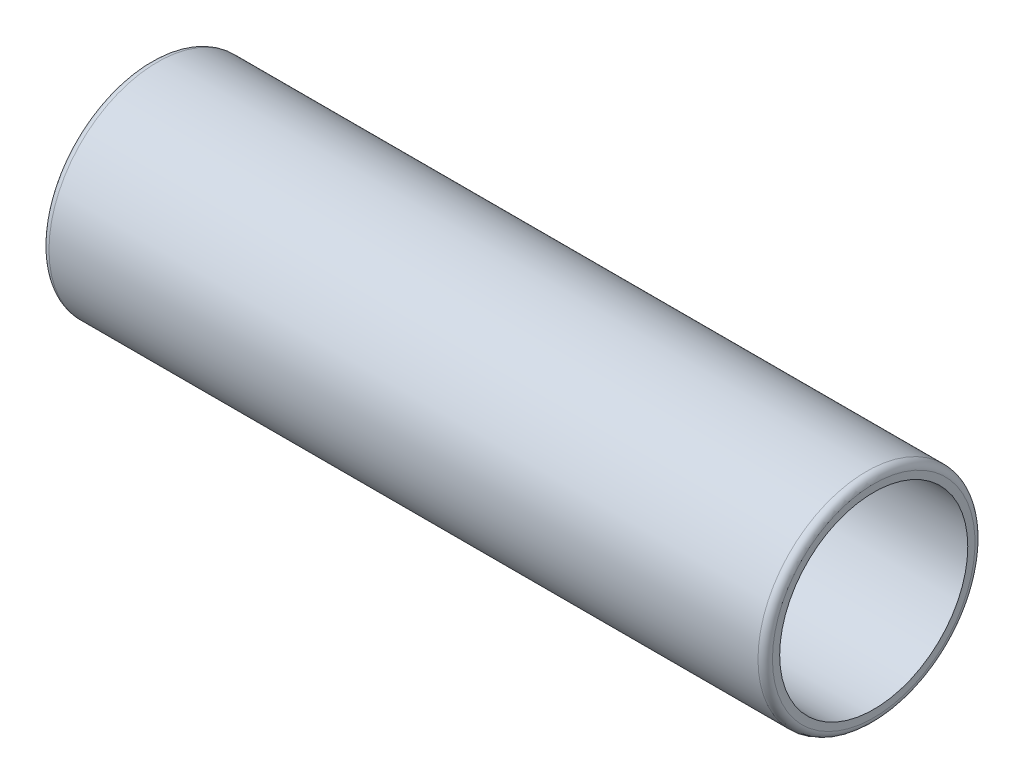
ISO-10303-21;
HEADER;
FILE_DESCRIPTION(('STEP AP214'),'2;1');
FILE_NAME('part.step','',(''),(''),'','','');
FILE_SCHEMA(('AUTOMOTIVE_DESIGN { 1 0 10303 214 1 1 1 1 }'));
ENDSEC;
DATA;
#1=APPLICATION_CONTEXT('core data for automotive mechanical design processes');
#2=APPLICATION_PROTOCOL_DEFINITION('international standard','automotive_design',2000,#1);
#3=PRODUCT_CONTEXT('',#1,'mechanical');
#4=PRODUCT('Part','Part','',(#3));
#5=PRODUCT_RELATED_PRODUCT_CATEGORY('part','',(#4));
#6=PRODUCT_DEFINITION_FORMATION('','',#4);
#7=PRODUCT_DEFINITION_CONTEXT('part definition',#1,'design');
#8=PRODUCT_DEFINITION('design','',#6,#7);
#9=PRODUCT_DEFINITION_SHAPE('','',#8);
#10=(LENGTH_UNIT() NAMED_UNIT(*) SI_UNIT(.MILLI.,.METRE.));
#11=(NAMED_UNIT(*) PLANE_ANGLE_UNIT() SI_UNIT($,.RADIAN.));
#12=(NAMED_UNIT(*) SI_UNIT($,.STERADIAN.) SOLID_ANGLE_UNIT());
#13=UNCERTAINTY_MEASURE_WITH_UNIT(LENGTH_MEASURE(1.E-05),#10,'distance_accuracy_value','');
#14=(GEOMETRIC_REPRESENTATION_CONTEXT(3) GLOBAL_UNCERTAINTY_ASSIGNED_CONTEXT((#13)) GLOBAL_UNIT_ASSIGNED_CONTEXT((#10,
#11,#12)) REPRESENTATION_CONTEXT('',''));
#15=CARTESIAN_POINT('',(0.,0.,0.));
#16=DIRECTION('',(0.,0.,1.));
#17=DIRECTION('',(1.,0.,0.));
#18=AXIS2_PLACEMENT_3D('',#15,#16,#17);
#19=CARTESIAN_POINT('',(0.,0.,0.));
#20=DIRECTION('',(-1.,0.,0.));
#21=DIRECTION('',(0.,0.,1.));
#22=AXIS2_PLACEMENT_3D('',#19,#20,#21);
#23=CYLINDRICAL_SURFACE('',#22,6.);
#24=CARTESIAN_POINT('',(6.,0.,0.));
#25=DIRECTION('',(-1.,0.,0.));
#26=DIRECTION('',(0.,0.,1.));
#27=AXIS2_PLACEMENT_3D('',#24,#25,#26);
#28=CIRCLE('',#27,6.);
#29=CARTESIAN_POINT('',(6.,0.,6.));
#30=VERTEX_POINT('',#29);
#31=EDGE_CURVE('E43',#30,#30,#28,.T.);
#32=ORIENTED_EDGE('',*,*,#31,.F.);
#33=EDGE_LOOP('',(#32));
#34=FACE_BOUND('',#33,.T.);
#35=CARTESIAN_POINT('',(0.,0.,0.));
#36=DIRECTION('',(-1.,0.,0.));
#37=DIRECTION('',(0.,0.,1.));
#38=AXIS2_PLACEMENT_3D('',#35,#36,#37);
#39=CIRCLE('',#38,6.);
#40=CARTESIAN_POINT('',(0.,0.,6.));
#41=VERTEX_POINT('',#40);
#42=EDGE_CURVE('E34',#41,#41,#39,.T.);
#43=ORIENTED_EDGE('',*,*,#42,.T.);
#44=EDGE_LOOP('',(#43));
#45=FACE_BOUND('',#44,.T.);
#46=ADVANCED_FACE('F14',(#34,#45),#23,.F.);
#47=CARTESIAN_POINT('',(0.,6.,0.));
#48=DIRECTION('',(1.,0.,0.));
#49=DIRECTION('',(0.,0.,-1.));
#50=AXIS2_PLACEMENT_3D('',#47,#48,#49);
#51=PLANE('',#50);
#52=CARTESIAN_POINT('',(0.,0.,0.));
#53=DIRECTION('',(1.,0.,0.));
#54=DIRECTION('',(0.,0.,-1.));
#55=AXIS2_PLACEMENT_3D('',#52,#53,#54);
#56=CIRCLE('',#55,14.);
#57=CARTESIAN_POINT('',(0.,0.,-14.));
#58=VERTEX_POINT('',#57);
#59=EDGE_CURVE('E21',#58,#58,#56,.F.);
#60=ORIENTED_EDGE('',*,*,#59,.T.);
#61=EDGE_LOOP('',(#60));
#62=FACE_BOUND('',#61,.T.);
#63=ORIENTED_EDGE('',*,*,#42,.F.);
#64=EDGE_LOOP('',(#63));
#65=FACE_BOUND('',#64,.T.);
#66=ADVANCED_FACE('F51',(#62,#65),#51,.F.);
#67=CARTESIAN_POINT('',(0.,0.,0.));
#68=DIRECTION('',(-1.,0.,0.));
#69=DIRECTION('',(0.,0.,1.));
#70=AXIS2_PLACEMENT_3D('',#67,#68,#69);
#71=CYLINDRICAL_SURFACE('',#70,15.);
#72=CARTESIAN_POINT('',(1.,0.,0.));
#73=DIRECTION('',(1.,0.,0.));
#74=DIRECTION('',(0.,0.,-1.));
#75=AXIS2_PLACEMENT_3D('',#72,#73,#74);
#76=CIRCLE('',#75,15.);
#77=CARTESIAN_POINT('',(1.,0.,-15.));
#78=VERTEX_POINT('',#77);
#79=EDGE_CURVE('E9',#78,#78,#76,.T.);
#80=ORIENTED_EDGE('',*,*,#79,.T.);
#81=EDGE_LOOP('',(#80));
#82=FACE_BOUND('',#81,.T.);
#83=CARTESIAN_POINT('',(99.,0.,0.));
#84=DIRECTION('',(-1.,0.,0.));
#85=DIRECTION('',(0.,0.,1.));
#86=AXIS2_PLACEMENT_3D('',#83,#84,#85);
#87=CIRCLE('',#86,15.);
#88=CARTESIAN_POINT('',(99.,0.,15.));
#89=VERTEX_POINT('',#88);
#90=EDGE_CURVE('E29',#89,#89,#87,.T.);
#91=ORIENTED_EDGE('',*,*,#90,.T.);
#92=EDGE_LOOP('',(#91));
#93=FACE_BOUND('',#92,.T.);
#94=ADVANCED_FACE('F56',(#82,#93),#71,.T.);
#95=CARTESIAN_POINT('',(100.,15.,0.));
#96=DIRECTION('',(-1.,0.,0.));
#97=DIRECTION('',(0.,0.,1.));
#98=AXIS2_PLACEMENT_3D('',#95,#96,#97);
#99=PLANE('',#98);
#100=CARTESIAN_POINT('',(100.,0.,0.));
#101=DIRECTION('',(-1.,0.,0.));
#102=DIRECTION('',(0.,0.,1.));
#103=AXIS2_PLACEMENT_3D('',#100,#101,#102);
#104=CIRCLE('',#103,14.);
#105=CARTESIAN_POINT('',(100.,0.,14.));
#106=VERTEX_POINT('',#105);
#107=EDGE_CURVE('E25',#106,#106,#104,.F.);
#108=ORIENTED_EDGE('',*,*,#107,.T.);
#109=EDGE_LOOP('',(#108));
#110=FACE_BOUND('',#109,.T.);
#111=CARTESIAN_POINT('',(100.,0.,0.));
#112=DIRECTION('',(-1.,0.,0.));
#113=DIRECTION('',(0.,0.,1.));
#114=AXIS2_PLACEMENT_3D('',#111,#112,#113);
#115=CIRCLE('',#114,13.);
#116=CARTESIAN_POINT('',(100.,0.,13.));
#117=VERTEX_POINT('',#116);
#118=EDGE_CURVE('E37',#117,#117,#115,.T.);
#119=ORIENTED_EDGE('',*,*,#118,.T.);
#120=EDGE_LOOP('',(#119));
#121=FACE_BOUND('',#120,.T.);
#122=ADVANCED_FACE('F63',(#110,#121),#99,.F.);
#123=CARTESIAN_POINT('',(0.,0.,0.));
#124=DIRECTION('',(-1.,0.,0.));
#125=DIRECTION('',(0.,0.,1.));
#126=AXIS2_PLACEMENT_3D('',#123,#124,#125);
#127=CYLINDRICAL_SURFACE('',#126,13.);
#128=ORIENTED_EDGE('',*,*,#118,.F.);
#129=EDGE_LOOP('',(#128));
#130=FACE_BOUND('',#129,.T.);
#131=CARTESIAN_POINT('',(13.,0.,0.));
#132=DIRECTION('',(-1.,0.,0.));
#133=DIRECTION('',(0.,0.,1.));
#134=AXIS2_PLACEMENT_3D('',#131,#132,#133);
#135=CIRCLE('',#134,13.);
#136=CARTESIAN_POINT('',(13.,0.,13.));
#137=VERTEX_POINT('',#136);
#138=EDGE_CURVE('E40',#137,#137,#135,.T.);
#139=ORIENTED_EDGE('',*,*,#138,.T.);
#140=EDGE_LOOP('',(#139));
#141=FACE_BOUND('',#140,.T.);
#142=ADVANCED_FACE('F75',(#130,#141),#127,.F.);
#143=CARTESIAN_POINT('',(6.,0.,0.));
#144=DIRECTION('',(1.,0.,0.));
#145=DIRECTION('',(0.,0.,-1.));
#146=AXIS2_PLACEMENT_3D('',#143,#144,#145);
#147=CONICAL_SURFACE('',#146,6.,0.785398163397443);
#148=ORIENTED_EDGE('',*,*,#138,.F.);
#149=EDGE_LOOP('',(#148));
#150=FACE_BOUND('',#149,.T.);
#151=ORIENTED_EDGE('',*,*,#31,.T.);
#152=EDGE_LOOP('',(#151));
#153=FACE_BOUND('',#152,.T.);
#154=ADVANCED_FACE('F47',(#150,#153),#147,.F.);
#155=CARTESIAN_POINT('',(99.,0.,0.));
#156=DIRECTION('',(-1.,0.,0.));
#157=DIRECTION('',(0.,0.,1.));
#158=AXIS2_PLACEMENT_3D('',#155,#156,#157);
#159=TOROIDAL_SURFACE('',#158,14.,1.);
#160=ORIENTED_EDGE('',*,*,#107,.F.);
#161=EDGE_LOOP('',(#160));
#162=FACE_BOUND('',#161,.T.);
#163=ORIENTED_EDGE('',*,*,#90,.F.);
#164=EDGE_LOOP('',(#163));
#165=FACE_BOUND('',#164,.T.);
#166=ADVANCED_FACE('F66',(#162,#165),#159,.T.);
#167=CARTESIAN_POINT('',(1.,0.,0.));
#168=DIRECTION('',(1.,0.,0.));
#169=DIRECTION('',(0.,0.,-1.));
#170=AXIS2_PLACEMENT_3D('',#167,#168,#169);
#171=TOROIDAL_SURFACE('',#170,14.,1.);
#172=ORIENTED_EDGE('',*,*,#79,.F.);
#173=EDGE_LOOP('',(#172));
#174=FACE_BOUND('',#173,.T.);
#175=ORIENTED_EDGE('',*,*,#59,.F.);
#176=EDGE_LOOP('',(#175));
#177=FACE_BOUND('',#176,.T.);
#178=ADVANCED_FACE('F16',(#174,#177),#171,.T.);
#179=CLOSED_SHELL('',(#46,#66,#94,#122,#142,#154,#166,#178));
#180=MANIFOLD_SOLID_BREP('B1',#179);
#181=ADVANCED_BREP_SHAPE_REPRESENTATION('',(#18,#180),#14);
#182=SHAPE_DEFINITION_REPRESENTATION(#9,#181);
ENDSEC;
END-ISO-10303-21;
